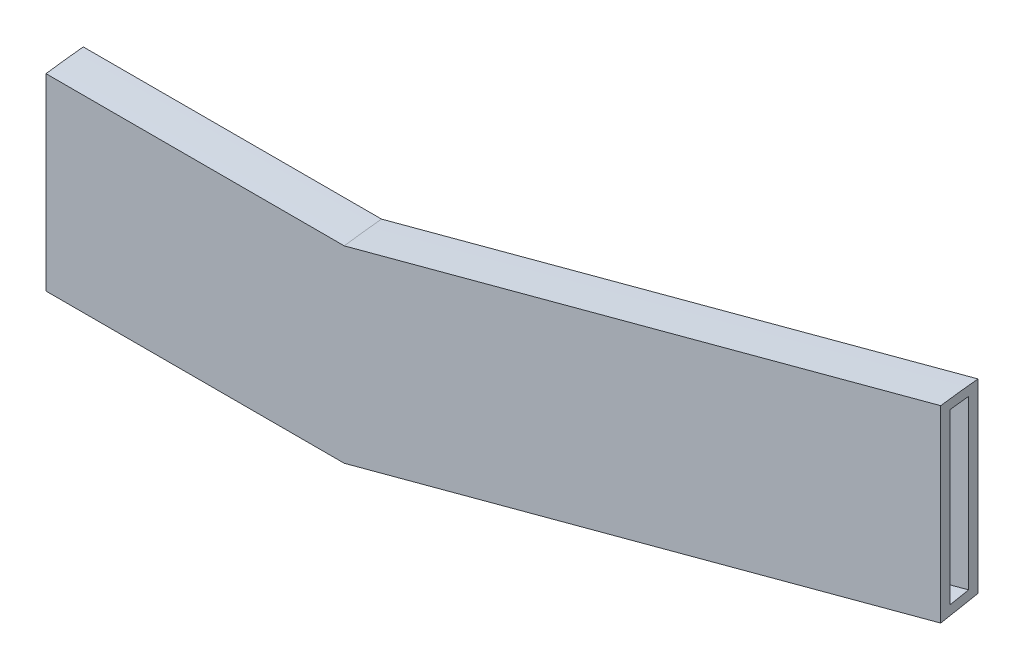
from build123d import *

# Parameters (mm, degrees)
BOSS_EXTRUDE1_DEPTH = 25.4


with BuildPart() as part:
    # Sketch1 → Boss-Extrude1 (new body)
    with BuildSketch(Plane(origin=(0, 0, 0), x_dir=(0, 0, -1), z_dir=(1, 0, 0))):
        with BuildLine():
            Line((32.54375, 18.223643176), (32.54375, 2.186214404))
            add(Edge.make_bspline(
                [(32.54375, 2.186214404), (33.60192669, 2.387238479), (34.660215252, 2.587677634), (35.71875, 2.786807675)],
                knots=[0.623360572, 0.623360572, 0.623360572, 0.623360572, 0.633917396, 0.633917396, 0.633917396, 0.633917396], degree=3))
            Line((35.71875, 2.786807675), (35.71875, 18.610370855))
            add(Edge.make_bspline(
                [(35.71875, 18.610370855), (34.657913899, 18.504004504), (33.599137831, 18.374784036), (32.54375, 18.223643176)],
                knots=[0.37069791, 0.37069791, 0.37069791, 0.37069791, 0.381261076, 0.381261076, 0.381261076, 0.381261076], degree=3))
        make_face()
        with BuildLine():
            Line((33.3375, 17.532319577), (33.3375, 3.14477122))
            add(Edge.make_bspline(
                [(33.3375, 3.14477122), (33.866623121, 3.245077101), (34.395784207, 3.345183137), (34.925, 3.444998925)],
                knots=[0.626491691, 0.626491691, 0.626491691, 0.626491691, 0.631767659, 0.631767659, 0.631767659, 0.631767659], degree=3))
            Line((34.925, 3.444998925), (34.925, 17.727804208))
            add(Edge.make_bspline(
                [(34.925, 17.727804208), (34.395165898, 17.668312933), (33.865942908, 17.603111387), (33.3375, 17.532319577)],
                knots=[0.373628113, 0.373628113, 0.373628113, 0.373628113, 0.378966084, 0.378966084, 0.378966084, 0.378966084], degree=3))
        make_face(mode=Mode.SUBTRACT)
    extrude(amount=BOSS_EXTRUDE1_DEPTH)

    # Sweep1: sweep along a path in Sketch4
    with BuildLine(Plane.XY.offset(-32.54375)) as sweep1_path:
        Line((25.4, 2.186214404), (76.2, 15.79803338))
    # Sketch7 → Sweep1 (sweep)
    with BuildSketch(Plane(origin=(25.4, 0, 0), x_dir=(0, 0, -1), z_dir=(1, 0, 0))):
        with BuildLine():
            Line((32.54375, 18.223643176), (32.54375, 2.186214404))
            add(Edge.make_bspline(
                [(32.54375, 2.186214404), (33.60192669, 2.387238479), (34.660215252, 2.587677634), (35.71875, 2.786807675)],
                knots=[0.623360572, 0.623360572, 0.623360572, 0.623360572, 0.633917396, 0.633917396, 0.633917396, 0.633917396], degree=3))
            Line((35.71875, 2.786807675), (35.71875, 18.610370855))
            add(Edge.make_bspline(
                [(35.71875, 18.610370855), (34.657913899, 18.504004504), (33.599137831, 18.374784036), (32.54375, 18.223643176)],
                knots=[0.37069791, 0.37069791, 0.37069791, 0.37069791, 0.381261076, 0.381261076, 0.381261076, 0.381261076], degree=3))
        make_face()
        with BuildLine():
            Line((33.3375, 17.532319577), (33.3375, 3.14477122))
            ThreePointArc((33.3375, 3.14477122), (34.131215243, 3.295068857), (34.925, 3.444998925))
            Line((34.925, 3.444998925), (34.925, 17.727804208))
            ThreePointArc((34.925, 17.727804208), (34.130728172, 17.634299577), (33.3375, 17.532319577))
        make_face(mode=Mode.SUBTRACT)
    sweep(path=sweep1_path.line)


solid = part.part
